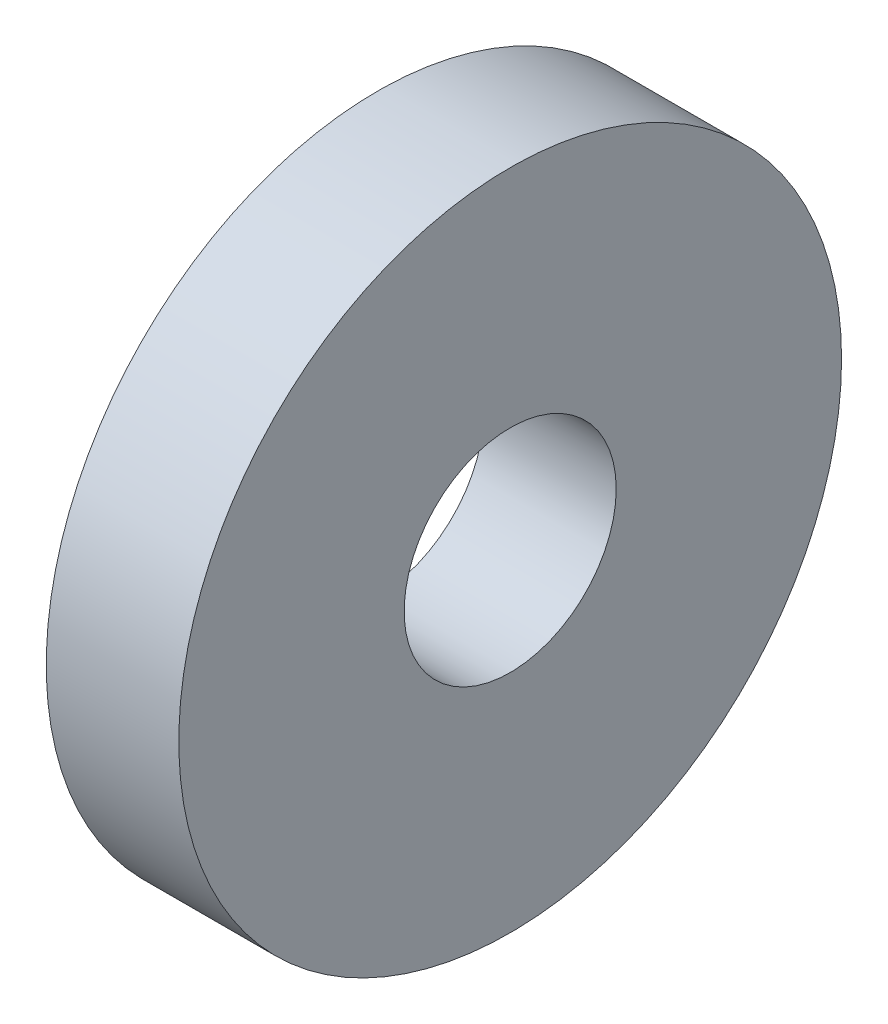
ISO-10303-21;
HEADER;
FILE_DESCRIPTION(('STEP AP214'),'2;1');
FILE_NAME('part.step','',(''),(''),'','','');
FILE_SCHEMA(('AUTOMOTIVE_DESIGN { 1 0 10303 214 1 1 1 1 }'));
ENDSEC;
DATA;
#1=APPLICATION_CONTEXT('core data for automotive mechanical design processes');
#2=APPLICATION_PROTOCOL_DEFINITION('international standard','automotive_design',2000,#1);
#3=PRODUCT_CONTEXT('',#1,'mechanical');
#4=PRODUCT('Part','Part','',(#3));
#5=PRODUCT_RELATED_PRODUCT_CATEGORY('part','',(#4));
#6=PRODUCT_DEFINITION_FORMATION('','',#4);
#7=PRODUCT_DEFINITION_CONTEXT('part definition',#1,'design');
#8=PRODUCT_DEFINITION('design','',#6,#7);
#9=PRODUCT_DEFINITION_SHAPE('','',#8);
#10=(LENGTH_UNIT() NAMED_UNIT(*) SI_UNIT(.MILLI.,.METRE.));
#11=(NAMED_UNIT(*) PLANE_ANGLE_UNIT() SI_UNIT($,.RADIAN.));
#12=(NAMED_UNIT(*) SI_UNIT($,.STERADIAN.) SOLID_ANGLE_UNIT());
#13=UNCERTAINTY_MEASURE_WITH_UNIT(LENGTH_MEASURE(1.E-05),#10,'distance_accuracy_value','');
#14=(GEOMETRIC_REPRESENTATION_CONTEXT(3) GLOBAL_UNCERTAINTY_ASSIGNED_CONTEXT((#13)) GLOBAL_UNIT_ASSIGNED_CONTEXT((#10,
#11,#12)) REPRESENTATION_CONTEXT('',''));
#15=CARTESIAN_POINT('',(0.,0.,0.));
#16=DIRECTION('',(0.,0.,1.));
#17=DIRECTION('',(1.,0.,0.));
#18=AXIS2_PLACEMENT_3D('',#15,#16,#17);
#19=CARTESIAN_POINT('',(3.81,0.,0.));
#20=DIRECTION('',(1.,0.,0.));
#21=DIRECTION('',(0.,0.,-1.));
#22=AXIS2_PLACEMENT_3D('',#19,#20,#21);
#23=PLANE('',#22);
#24=CARTESIAN_POINT('',(3.81,0.,0.));
#25=DIRECTION('',(1.,0.,0.));
#26=DIRECTION('',(0.,0.,-1.));
#27=AXIS2_PLACEMENT_3D('',#24,#25,#26);
#28=CIRCLE('',#27,9.525);
#29=CARTESIAN_POINT('',(3.81,0.,-9.525));
#30=VERTEX_POINT('',#29);
#31=EDGE_CURVE('E10',#30,#30,#28,.T.);
#32=ORIENTED_EDGE('',*,*,#31,.T.);
#33=EDGE_LOOP('',(#32));
#34=FACE_BOUND('',#33,.T.);
#35=CARTESIAN_POINT('',(3.81,0.,0.));
#36=DIRECTION('',(1.,0.,0.));
#37=DIRECTION('',(0.,0.,-1.));
#38=AXIS2_PLACEMENT_3D('',#35,#36,#37);
#39=CIRCLE('',#38,3.048);
#40=CARTESIAN_POINT('',(3.81,0.,-3.048));
#41=VERTEX_POINT('',#40);
#42=EDGE_CURVE('E42',#41,#41,#39,.T.);
#43=ORIENTED_EDGE('',*,*,#42,.F.);
#44=EDGE_LOOP('',(#43));
#45=FACE_BOUND('',#44,.T.);
#46=ADVANCED_FACE('F31',(#34,#45),#23,.T.);
#47=CARTESIAN_POINT('',(0.,0.,0.));
#48=DIRECTION('',(1.,0.,0.));
#49=DIRECTION('',(0.,0.,-1.));
#50=AXIS2_PLACEMENT_3D('',#47,#48,#49);
#51=PLANE('',#50);
#52=CARTESIAN_POINT('',(0.,0.,0.));
#53=DIRECTION('',(1.,0.,0.));
#54=DIRECTION('',(0.,0.,-1.));
#55=AXIS2_PLACEMENT_3D('',#52,#53,#54);
#56=CIRCLE('',#55,9.525);
#57=CARTESIAN_POINT('',(0.,0.,-9.525));
#58=VERTEX_POINT('',#57);
#59=EDGE_CURVE('E35',#58,#58,#56,.T.);
#60=ORIENTED_EDGE('',*,*,#59,.F.);
#61=EDGE_LOOP('',(#60));
#62=FACE_BOUND('',#61,.T.);
#63=CARTESIAN_POINT('',(0.,0.,0.));
#64=DIRECTION('',(1.,0.,0.));
#65=DIRECTION('',(0.,0.,-1.));
#66=AXIS2_PLACEMENT_3D('',#63,#64,#65);
#67=CIRCLE('',#66,3.048);
#68=CARTESIAN_POINT('',(0.,0.,-3.048));
#69=VERTEX_POINT('',#68);
#70=EDGE_CURVE('E44',#69,#69,#67,.T.);
#71=ORIENTED_EDGE('',*,*,#70,.T.);
#72=EDGE_LOOP('',(#71));
#73=FACE_BOUND('',#72,.T.);
#74=ADVANCED_FACE('F54',(#62,#73),#51,.F.);
#75=CARTESIAN_POINT('',(3.81,0.,0.));
#76=DIRECTION('',(-1.,0.,0.));
#77=DIRECTION('',(0.,0.,1.));
#78=AXIS2_PLACEMENT_3D('',#75,#76,#77);
#79=CYLINDRICAL_SURFACE('',#78,9.525);
#80=ORIENTED_EDGE('',*,*,#31,.F.);
#81=EDGE_LOOP('',(#80));
#82=FACE_BOUND('',#81,.T.);
#83=ORIENTED_EDGE('',*,*,#59,.T.);
#84=EDGE_LOOP('',(#83));
#85=FACE_BOUND('',#84,.T.);
#86=ADVANCED_FACE('F33',(#82,#85),#79,.T.);
#87=CARTESIAN_POINT('',(3.81,0.,0.));
#88=DIRECTION('',(-1.,0.,0.));
#89=DIRECTION('',(0.,0.,1.));
#90=AXIS2_PLACEMENT_3D('',#87,#88,#89);
#91=CYLINDRICAL_SURFACE('',#90,3.048);
#92=ORIENTED_EDGE('',*,*,#42,.T.);
#93=EDGE_LOOP('',(#92));
#94=FACE_BOUND('',#93,.T.);
#95=ORIENTED_EDGE('',*,*,#70,.F.);
#96=EDGE_LOOP('',(#95));
#97=FACE_BOUND('',#96,.T.);
#98=ADVANCED_FACE('F50',(#94,#97),#91,.F.);
#99=CLOSED_SHELL('',(#46,#74,#86,#98));
#100=MANIFOLD_SOLID_BREP('B2',#99);
#101=ADVANCED_BREP_SHAPE_REPRESENTATION('',(#18,#100),#14);
#102=SHAPE_DEFINITION_REPRESENTATION(#9,#101);
ENDSEC;
END-ISO-10303-21;
